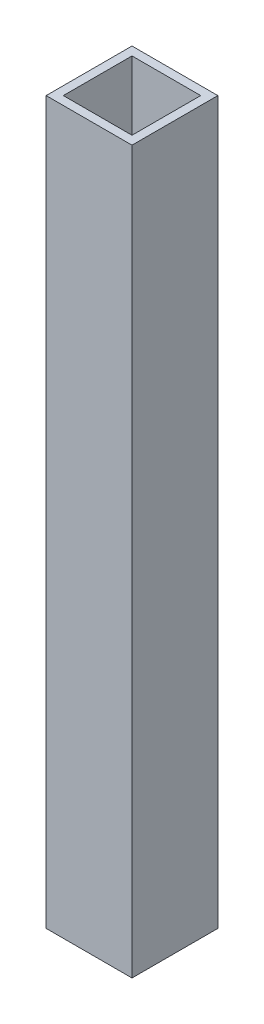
ISO-10303-21;
HEADER;
FILE_DESCRIPTION(('STEP AP214'),'2;1');
FILE_NAME('part.step','',(''),(''),'','','');
FILE_SCHEMA(('AUTOMOTIVE_DESIGN { 1 0 10303 214 1 1 1 1 }'));
ENDSEC;
DATA;
#1=APPLICATION_CONTEXT('core data for automotive mechanical design processes');
#2=APPLICATION_PROTOCOL_DEFINITION('international standard','automotive_design',2000,#1);
#3=PRODUCT_CONTEXT('',#1,'mechanical');
#4=PRODUCT('Part','Part','',(#3));
#5=PRODUCT_RELATED_PRODUCT_CATEGORY('part','',(#4));
#6=PRODUCT_DEFINITION_FORMATION('','',#4);
#7=PRODUCT_DEFINITION_CONTEXT('part definition',#1,'design');
#8=PRODUCT_DEFINITION('design','',#6,#7);
#9=PRODUCT_DEFINITION_SHAPE('','',#8);
#10=(LENGTH_UNIT() NAMED_UNIT(*) SI_UNIT(.MILLI.,.METRE.));
#11=(NAMED_UNIT(*) PLANE_ANGLE_UNIT() SI_UNIT($,.RADIAN.));
#12=(NAMED_UNIT(*) SI_UNIT($,.STERADIAN.) SOLID_ANGLE_UNIT());
#13=UNCERTAINTY_MEASURE_WITH_UNIT(LENGTH_MEASURE(1.E-05),#10,'distance_accuracy_value','');
#14=(GEOMETRIC_REPRESENTATION_CONTEXT(3) GLOBAL_UNCERTAINTY_ASSIGNED_CONTEXT((#13)) GLOBAL_UNIT_ASSIGNED_CONTEXT((#10,
#11,#12)) REPRESENTATION_CONTEXT('',''));
#15=CARTESIAN_POINT('',(0.,0.,0.));
#16=DIRECTION('',(0.,0.,1.));
#17=DIRECTION('',(1.,0.,0.));
#18=AXIS2_PLACEMENT_3D('',#15,#16,#17);
#19=CARTESIAN_POINT('',(0.,84.,0.));
#20=DIRECTION('',(0.,1.,0.));
#21=DIRECTION('',(0.,0.,1.));
#22=AXIS2_PLACEMENT_3D('',#19,#20,#21);
#23=PLANE('',#22);
#24=DIRECTION('',(0.,0.,-1.));
#25=VECTOR('',#24,1.);
#26=CARTESIAN_POINT('',(5.,84.,-5.));
#27=LINE('',#26,#25);
#28=CARTESIAN_POINT('',(5.,84.,5.));
#29=VERTEX_POINT('',#28);
#30=CARTESIAN_POINT('',(5.,84.,-5.));
#31=VERTEX_POINT('',#30);
#32=EDGE_CURVE('E133',#29,#31,#27,.T.);
#33=ORIENTED_EDGE('',*,*,#32,.T.);
#34=DIRECTION('',(-1.,0.,0.));
#35=VECTOR('',#34,1.);
#36=CARTESIAN_POINT('',(-5.,84.,-5.));
#37=LINE('',#36,#35);
#38=CARTESIAN_POINT('',(-5.,84.,-5.));
#39=VERTEX_POINT('',#38);
#40=EDGE_CURVE('E136',#31,#39,#37,.T.);
#41=ORIENTED_EDGE('',*,*,#40,.T.);
#42=DIRECTION('',(0.,0.,1.));
#43=VECTOR('',#42,1.);
#44=CARTESIAN_POINT('',(-5.,84.,-5.));
#45=LINE('',#44,#43);
#46=CARTESIAN_POINT('',(-5.,84.,5.));
#47=VERTEX_POINT('',#46);
#48=EDGE_CURVE('E139',#39,#47,#45,.T.);
#49=ORIENTED_EDGE('',*,*,#48,.T.);
#50=DIRECTION('',(1.,0.,0.));
#51=VECTOR('',#50,1.);
#52=CARTESIAN_POINT('',(-5.,84.,5.));
#53=LINE('',#52,#51);
#54=EDGE_CURVE('E141',#47,#29,#53,.T.);
#55=ORIENTED_EDGE('',*,*,#54,.T.);
#56=EDGE_LOOP('',(#33,#41,#49,#55));
#57=FACE_BOUND('',#56,.T.);
#58=DIRECTION('',(-1.,0.,0.));
#59=VECTOR('',#58,1.);
#60=CARTESIAN_POINT('',(-4.,84.,-4.));
#61=LINE('',#60,#59);
#62=CARTESIAN_POINT('',(4.,84.,-4.));
#63=VERTEX_POINT('',#62);
#64=CARTESIAN_POINT('',(-4.,84.,-4.));
#65=VERTEX_POINT('',#64);
#66=EDGE_CURVE('E105',#63,#65,#61,.T.);
#67=ORIENTED_EDGE('',*,*,#66,.F.);
#68=DIRECTION('',(0.,0.,-1.));
#69=VECTOR('',#68,1.);
#70=CARTESIAN_POINT('',(4.,84.,4.));
#71=LINE('',#70,#69);
#72=CARTESIAN_POINT('',(4.,84.,4.));
#73=VERTEX_POINT('',#72);
#74=EDGE_CURVE('E97',#73,#63,#71,.T.);
#75=ORIENTED_EDGE('',*,*,#74,.F.);
#76=DIRECTION('',(1.,0.,0.));
#77=VECTOR('',#76,1.);
#78=CARTESIAN_POINT('',(-4.,84.,4.));
#79=LINE('',#78,#77);
#80=CARTESIAN_POINT('',(-4.,84.,4.));
#81=VERTEX_POINT('',#80);
#82=EDGE_CURVE('E119',#81,#73,#79,.T.);
#83=ORIENTED_EDGE('',*,*,#82,.F.);
#84=DIRECTION('',(0.,0.,1.));
#85=VECTOR('',#84,1.);
#86=CARTESIAN_POINT('',(-4.,84.,4.));
#87=LINE('',#86,#85);
#88=EDGE_CURVE('E117',#65,#81,#87,.T.);
#89=ORIENTED_EDGE('',*,*,#88,.F.);
#90=EDGE_LOOP('',(#67,#75,#83,#89));
#91=FACE_BOUND('',#90,.T.);
#92=ADVANCED_FACE('F32',(#57,#91),#23,.T.);
#93=CARTESIAN_POINT('',(0.,0.,0.));
#94=DIRECTION('',(0.,1.,0.));
#95=DIRECTION('',(0.,0.,1.));
#96=AXIS2_PLACEMENT_3D('',#93,#94,#95);
#97=PLANE('',#96);
#98=DIRECTION('',(0.,0.,-1.));
#99=VECTOR('',#98,1.);
#100=CARTESIAN_POINT('',(5.,0.,-5.));
#101=LINE('',#100,#99);
#102=CARTESIAN_POINT('',(5.,0.,5.));
#103=VERTEX_POINT('',#102);
#104=CARTESIAN_POINT('',(5.,0.,-5.));
#105=VERTEX_POINT('',#104);
#106=EDGE_CURVE('E113',#103,#105,#101,.T.);
#107=ORIENTED_EDGE('',*,*,#106,.F.);
#108=DIRECTION('',(1.,0.,0.));
#109=VECTOR('',#108,1.);
#110=CARTESIAN_POINT('',(-5.,0.,5.));
#111=LINE('',#110,#109);
#112=CARTESIAN_POINT('',(-5.,0.,5.));
#113=VERTEX_POINT('',#112);
#114=EDGE_CURVE('E137',#113,#103,#111,.T.);
#115=ORIENTED_EDGE('',*,*,#114,.F.);
#116=DIRECTION('',(0.,0.,1.));
#117=VECTOR('',#116,1.);
#118=CARTESIAN_POINT('',(-5.,0.,-5.));
#119=LINE('',#118,#117);
#120=CARTESIAN_POINT('',(-5.,0.,-5.));
#121=VERTEX_POINT('',#120);
#122=EDGE_CURVE('E148',#121,#113,#119,.T.);
#123=ORIENTED_EDGE('',*,*,#122,.F.);
#124=DIRECTION('',(-1.,0.,0.));
#125=VECTOR('',#124,1.);
#126=CARTESIAN_POINT('',(-5.,0.,-5.));
#127=LINE('',#126,#125);
#128=EDGE_CURVE('E146',#105,#121,#127,.T.);
#129=ORIENTED_EDGE('',*,*,#128,.F.);
#130=EDGE_LOOP('',(#107,#115,#123,#129));
#131=FACE_BOUND('',#130,.T.);
#132=DIRECTION('',(0.,0.,-1.));
#133=VECTOR('',#132,1.);
#134=CARTESIAN_POINT('',(4.,0.,4.));
#135=LINE('',#134,#133);
#136=CARTESIAN_POINT('',(4.,0.,4.));
#137=VERTEX_POINT('',#136);
#138=CARTESIAN_POINT('',(4.,0.,-4.));
#139=VERTEX_POINT('',#138);
#140=EDGE_CURVE('E55',#137,#139,#135,.T.);
#141=ORIENTED_EDGE('',*,*,#140,.T.);
#142=DIRECTION('',(-1.,0.,0.));
#143=VECTOR('',#142,1.);
#144=CARTESIAN_POINT('',(-4.,0.,-4.));
#145=LINE('',#144,#143);
#146=CARTESIAN_POINT('',(-4.,0.,-4.));
#147=VERTEX_POINT('',#146);
#148=EDGE_CURVE('E112',#139,#147,#145,.T.);
#149=ORIENTED_EDGE('',*,*,#148,.T.);
#150=DIRECTION('',(0.,0.,1.));
#151=VECTOR('',#150,1.);
#152=CARTESIAN_POINT('',(-4.,0.,4.));
#153=LINE('',#152,#151);
#154=CARTESIAN_POINT('',(-4.,0.,4.));
#155=VERTEX_POINT('',#154);
#156=EDGE_CURVE('E125',#147,#155,#153,.T.);
#157=ORIENTED_EDGE('',*,*,#156,.T.);
#158=DIRECTION('',(1.,0.,0.));
#159=VECTOR('',#158,1.);
#160=CARTESIAN_POINT('',(-4.,0.,4.));
#161=LINE('',#160,#159);
#162=EDGE_CURVE('E106',#155,#137,#161,.T.);
#163=ORIENTED_EDGE('',*,*,#162,.T.);
#164=EDGE_LOOP('',(#141,#149,#157,#163));
#165=FACE_BOUND('',#164,.T.);
#166=ADVANCED_FACE('F166',(#131,#165),#97,.F.);
#167=CARTESIAN_POINT('',(5.,84.,-5.));
#168=DIRECTION('',(-1.,0.,0.));
#169=DIRECTION('',(0.,0.,1.));
#170=AXIS2_PLACEMENT_3D('',#167,#168,#169);
#171=PLANE('',#170);
#172=ORIENTED_EDGE('',*,*,#106,.T.);
#173=DIRECTION('',(0.,-1.,0.));
#174=VECTOR('',#173,1.);
#175=CARTESIAN_POINT('',(5.,84.,-5.));
#176=LINE('',#175,#174);
#177=EDGE_CURVE('E11',#31,#105,#176,.T.);
#178=ORIENTED_EDGE('',*,*,#177,.F.);
#179=ORIENTED_EDGE('',*,*,#32,.F.);
#180=DIRECTION('',(0.,-1.,0.));
#181=VECTOR('',#180,1.);
#182=CARTESIAN_POINT('',(5.,84.,5.));
#183=LINE('',#182,#181);
#184=EDGE_CURVE('E143',#29,#103,#183,.T.);
#185=ORIENTED_EDGE('',*,*,#184,.T.);
#186=EDGE_LOOP('',(#172,#178,#179,#185));
#187=FACE_BOUND('',#186,.T.);
#188=ADVANCED_FACE('F34',(#187),#171,.F.);
#189=CARTESIAN_POINT('',(-5.,84.,-5.));
#190=DIRECTION('',(0.,0.,1.));
#191=DIRECTION('',(1.,0.,0.));
#192=AXIS2_PLACEMENT_3D('',#189,#190,#191);
#193=PLANE('',#192);
#194=ORIENTED_EDGE('',*,*,#128,.T.);
#195=DIRECTION('',(0.,-1.,0.));
#196=VECTOR('',#195,1.);
#197=CARTESIAN_POINT('',(-5.,84.,-5.));
#198=LINE('',#197,#196);
#199=EDGE_CURVE('E40',#39,#121,#198,.T.);
#200=ORIENTED_EDGE('',*,*,#199,.F.);
#201=ORIENTED_EDGE('',*,*,#40,.F.);
#202=ORIENTED_EDGE('',*,*,#177,.T.);
#203=EDGE_LOOP('',(#194,#200,#201,#202));
#204=FACE_BOUND('',#203,.T.);
#205=ADVANCED_FACE('F176',(#204),#193,.F.);
#206=CARTESIAN_POINT('',(-5.,84.,-5.));
#207=DIRECTION('',(1.,0.,0.));
#208=DIRECTION('',(0.,0.,-1.));
#209=AXIS2_PLACEMENT_3D('',#206,#207,#208);
#210=PLANE('',#209);
#211=ORIENTED_EDGE('',*,*,#122,.T.);
#212=DIRECTION('',(0.,-1.,0.));
#213=VECTOR('',#212,1.);
#214=CARTESIAN_POINT('',(-5.,84.,5.));
#215=LINE('',#214,#213);
#216=EDGE_CURVE('E153',#47,#113,#215,.T.);
#217=ORIENTED_EDGE('',*,*,#216,.F.);
#218=ORIENTED_EDGE('',*,*,#48,.F.);
#219=ORIENTED_EDGE('',*,*,#199,.T.);
#220=EDGE_LOOP('',(#211,#217,#218,#219));
#221=FACE_BOUND('',#220,.T.);
#222=ADVANCED_FACE('F160',(#221),#210,.F.);
#223=CARTESIAN_POINT('',(-5.,84.,5.));
#224=DIRECTION('',(0.,0.,-1.));
#225=DIRECTION('',(-1.,0.,0.));
#226=AXIS2_PLACEMENT_3D('',#223,#224,#225);
#227=PLANE('',#226);
#228=ORIENTED_EDGE('',*,*,#114,.T.);
#229=ORIENTED_EDGE('',*,*,#184,.F.);
#230=ORIENTED_EDGE('',*,*,#54,.F.);
#231=ORIENTED_EDGE('',*,*,#216,.T.);
#232=EDGE_LOOP('',(#228,#229,#230,#231));
#233=FACE_BOUND('',#232,.T.);
#234=ADVANCED_FACE('F170',(#233),#227,.F.);
#235=CARTESIAN_POINT('',(4.,84.,4.));
#236=DIRECTION('',(-1.,0.,0.));
#237=DIRECTION('',(0.,0.,1.));
#238=AXIS2_PLACEMENT_3D('',#235,#236,#237);
#239=PLANE('',#238);
#240=ORIENTED_EDGE('',*,*,#140,.F.);
#241=DIRECTION('',(0.,-1.,0.));
#242=VECTOR('',#241,1.);
#243=CARTESIAN_POINT('',(4.,84.,4.));
#244=LINE('',#243,#242);
#245=EDGE_CURVE('E101',#73,#137,#244,.T.);
#246=ORIENTED_EDGE('',*,*,#245,.F.);
#247=ORIENTED_EDGE('',*,*,#74,.T.);
#248=DIRECTION('',(0.,-1.,0.));
#249=VECTOR('',#248,1.);
#250=CARTESIAN_POINT('',(4.,84.,-4.));
#251=LINE('',#250,#249);
#252=EDGE_CURVE('E100',#63,#139,#251,.T.);
#253=ORIENTED_EDGE('',*,*,#252,.T.);
#254=EDGE_LOOP('',(#240,#246,#247,#253));
#255=FACE_BOUND('',#254,.T.);
#256=ADVANCED_FACE('F99',(#255),#239,.T.);
#257=CARTESIAN_POINT('',(-4.,84.,-4.));
#258=DIRECTION('',(0.,0.,1.));
#259=DIRECTION('',(1.,0.,0.));
#260=AXIS2_PLACEMENT_3D('',#257,#258,#259);
#261=PLANE('',#260);
#262=ORIENTED_EDGE('',*,*,#148,.F.);
#263=ORIENTED_EDGE('',*,*,#252,.F.);
#264=ORIENTED_EDGE('',*,*,#66,.T.);
#265=DIRECTION('',(0.,-1.,0.));
#266=VECTOR('',#265,1.);
#267=CARTESIAN_POINT('',(-4.,84.,-4.));
#268=LINE('',#267,#266);
#269=EDGE_CURVE('E114',#65,#147,#268,.T.);
#270=ORIENTED_EDGE('',*,*,#269,.T.);
#271=EDGE_LOOP('',(#262,#263,#264,#270));
#272=FACE_BOUND('',#271,.T.);
#273=ADVANCED_FACE('F109',(#272),#261,.T.);
#274=CARTESIAN_POINT('',(-4.,84.,4.));
#275=DIRECTION('',(1.,0.,0.));
#276=DIRECTION('',(0.,0.,-1.));
#277=AXIS2_PLACEMENT_3D('',#274,#275,#276);
#278=PLANE('',#277);
#279=ORIENTED_EDGE('',*,*,#156,.F.);
#280=ORIENTED_EDGE('',*,*,#269,.F.);
#281=ORIENTED_EDGE('',*,*,#88,.T.);
#282=DIRECTION('',(0.,-1.,0.));
#283=VECTOR('',#282,1.);
#284=CARTESIAN_POINT('',(-4.,84.,4.));
#285=LINE('',#284,#283);
#286=EDGE_CURVE('E47',#81,#155,#285,.T.);
#287=ORIENTED_EDGE('',*,*,#286,.T.);
#288=EDGE_LOOP('',(#279,#280,#281,#287));
#289=FACE_BOUND('',#288,.T.);
#290=ADVANCED_FACE('F199',(#289),#278,.T.);
#291=CARTESIAN_POINT('',(-4.,84.,4.));
#292=DIRECTION('',(0.,0.,-1.));
#293=DIRECTION('',(-1.,0.,0.));
#294=AXIS2_PLACEMENT_3D('',#291,#292,#293);
#295=PLANE('',#294);
#296=ORIENTED_EDGE('',*,*,#162,.F.);
#297=ORIENTED_EDGE('',*,*,#286,.F.);
#298=ORIENTED_EDGE('',*,*,#82,.T.);
#299=ORIENTED_EDGE('',*,*,#245,.T.);
#300=EDGE_LOOP('',(#296,#297,#298,#299));
#301=FACE_BOUND('',#300,.T.);
#302=ADVANCED_FACE('F203',(#301),#295,.T.);
#303=CLOSED_SHELL('',(#92,#166,#188,#205,#222,#234,#256,#273,#290,#302));
#304=MANIFOLD_SOLID_BREP('B2',#303);
#305=ADVANCED_BREP_SHAPE_REPRESENTATION('',(#18,#304),#14);
#306=SHAPE_DEFINITION_REPRESENTATION(#9,#305);
ENDSEC;
END-ISO-10303-21;
